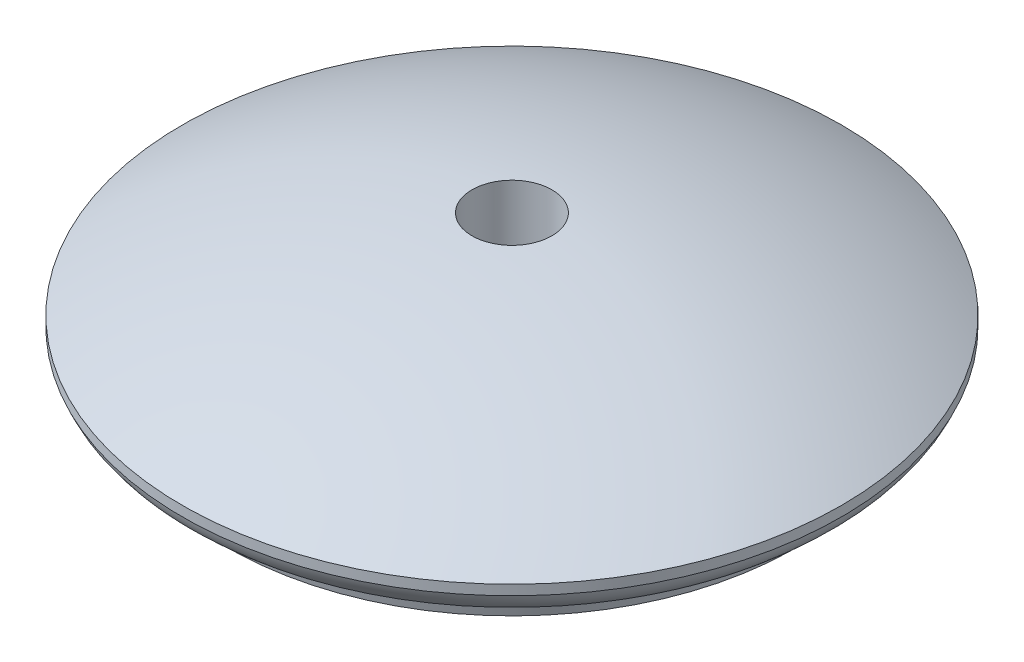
from build123d import *

# Parameters (mm, degrees)
CROQUIS1_W = 145
CROQUIS1_H = 5


with BuildPart() as part:
    # Croquis1 → Revoluci_n1 (revolve)
    with BuildSketch(Plane.XY, mode=Mode.PRIVATE) as revoluci_n1_sk:
        with BuildLine():
            Line((20, 30), (165, 30))
            ThreePointArc((165, 30), (95.124842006, 60.767219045), (20, 74.384031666))
            Line((20, 74.384031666), (20, 30))
        make_face()
        with Locations((92.5, 27.5)):
            Rectangle(CROQUIS1_W, CROQUIS1_H)
        with BuildLine():
            Line((20, 10), (143.814700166, 10))
            ThreePointArc((143.814700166, 10), (156.793692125, 14.129641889), (165, 25))
            Line((165, 25), (20, 25))
            Line((20, 25), (20, 10))
        make_face()
        Polygon((0, 0), (142, 0), (143.814700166, 10), (0, 10), align=None)
    revolve(revoluci_n1_sk.sketch.rotate(Axis((0, 0, 0), (0, 1, 0)), 90), axis=Axis((0, 0, 0), (0, 1, 0)))


solid = part.part
